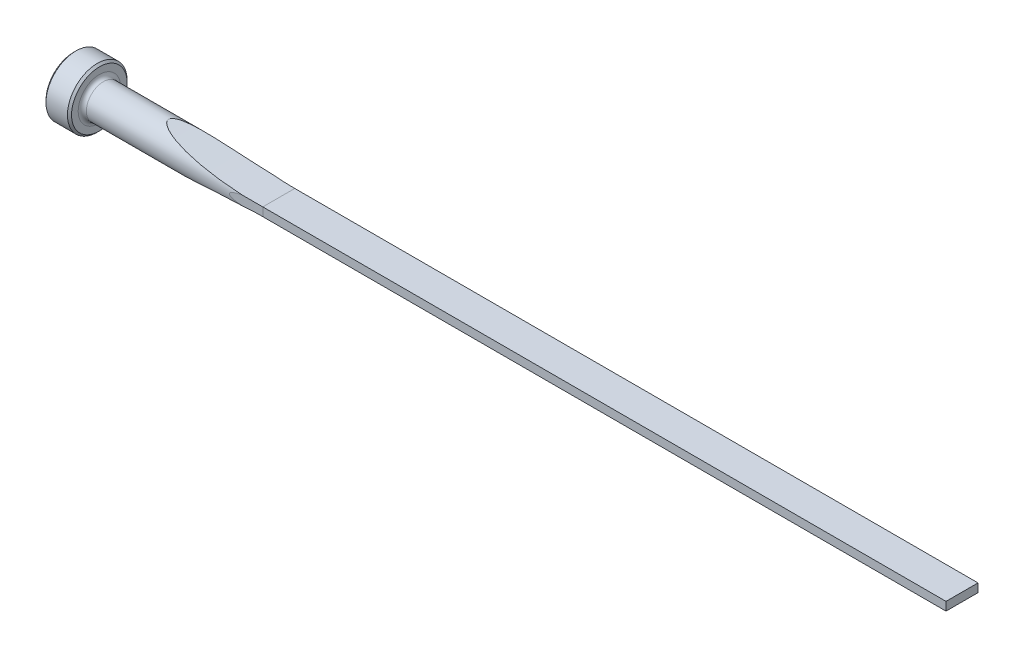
from build123d import *

# Parameters (mm, degrees)
CUT_EXTRUDE1_DEPTH = 166.286456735
CUT_EXTRUDE2_DEPTH = 166.286456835
FILLET1_R          = 0.762
CHAMFER1_SIZE      = 0.381


with BuildPart() as part:
    # Sketch1 → Revolve1 (revolve)
    with BuildSketch(Plane.XY, mode=Mode.PRIVATE) as revolve1_sk:
        Polygon((0, 0), (0, 5.5499), (4.7498, 5.5499), (4.7498, 3.175), (165.1, 3.175), (165.1, 0), align=None)
    revolve(revolve1_sk.sketch.rotate(Axis((0, 0, 0), (1, 0, 0)), 90), axis=Axis((0, 0, 0), (1, 0, 0)))

    # Sketch2 → Cut-Extrude1 (cut, symmetric)
    with BuildSketch(Plane.XY):
        with BuildLine():
            Line((165.1, 3.175), (165.1, 0.7874))
            Line((165.1, 0.7874), (38.1, 0.7874))
            ThreePointArc((38.1, 0.7874), (27.798115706, 1.386317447), (17.635038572, 3.175))
            Line((17.635038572, 3.175), (165.1, 3.175))
        make_face()
    cut_extrude1 = extrude(amount=CUT_EXTRUDE1_DEPTH, both=True, mode=Mode.SUBTRACT)

    # Mirror1: Cut-Extrude1 across plane
    add(cut_extrude1.mirror(Plane.ZX), mode=Mode.SUBTRACT)

    # Sketch3 → Cut-Extrude2 (cut, symmetric)
    with BuildSketch(Plane(origin=(0, 0, 0), x_dir=(1, 0, 0), z_dir=(0, 1, 0))):
        with BuildLine():
            Line((165.1, 3.175), (165.1, 2.9718))
            Line((165.1, 2.9718), (38.1, 2.9718))
            ThreePointArc((38.1, 2.9718), (35.09463147, 3.022614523), (32.092698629, 3.175))
            Line((32.092698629, 3.175), (165.1, 3.175))
        make_face()
    cut_extrude2 = extrude(amount=CUT_EXTRUDE2_DEPTH, both=True, mode=Mode.SUBTRACT)

    # Mirror2: Cut-Extrude2 across plane
    add(cut_extrude2.mirror(Plane.XY), mode=Mode.SUBTRACT)

    # Fillet1
    fillet1_edges = [part.edges().sort_by_distance(p)[0] for p in [
        (4.7498, 0, -3.175),
    ]]
    fillet(fillet1_edges, radius=FILLET1_R)

    # Chamfer1
    chamfer1_edges = [part.edges().sort_by_distance(p)[0] for p in [
        (4.7498, 0, -5.5499),
        (0, 0, -5.5499),
    ]]
    chamfer(chamfer1_edges, length=CHAMFER1_SIZE)


solid = part.part
